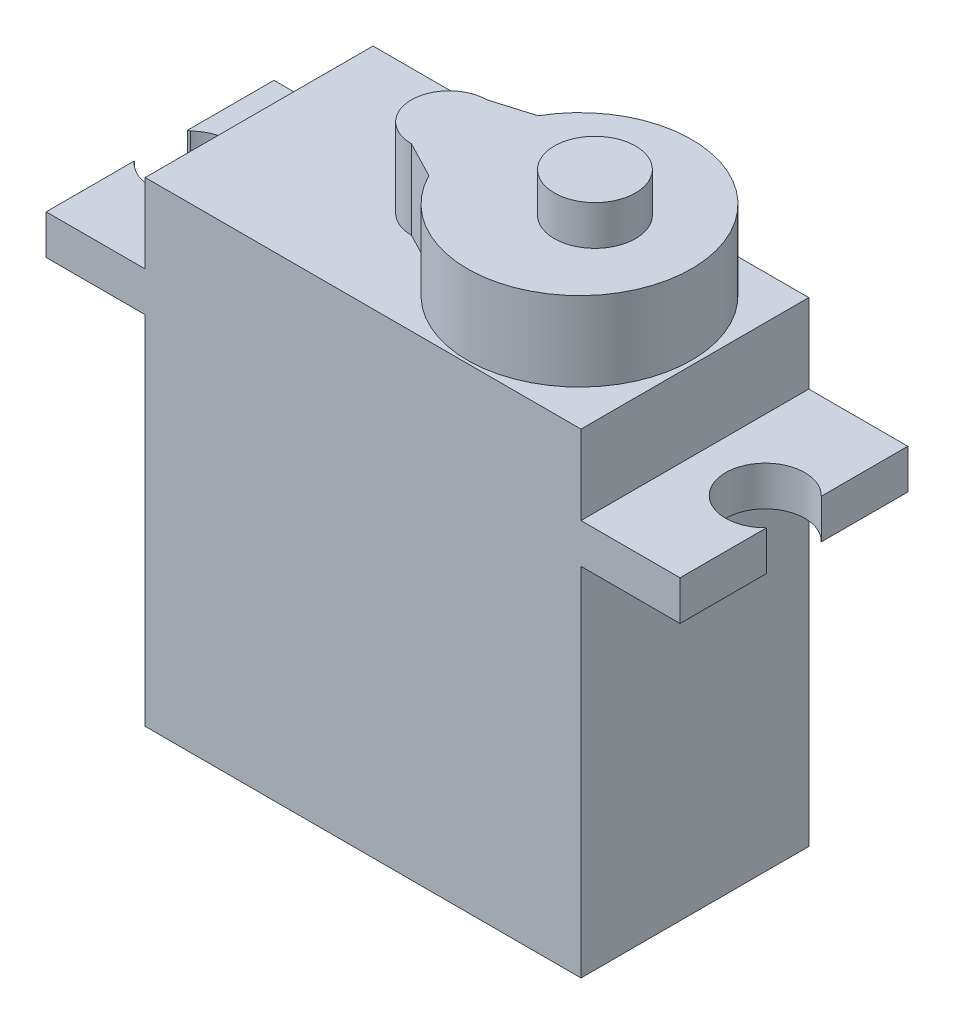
from build123d import *

# Parameters (mm, degrees)
SKETCH1_W                = 22
SKETCH1_H                = 11.5
BOSS_EXTRUDE1_DEPTH      = 24
BOSS_EXTRUDE2_DEPTH      = 5
BOSS_EXTRUDE2_DEPTH_BACK = 27
SKETCH2_W                = 11.5
SKETCH2_H                = 2
CUT_EXTRUDE3_DEPTH       = 7
BOSS_EXTRUDE5_DEPTH      = 4
SKETCH5_R                = 2.051313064
BOSS_EXTRUDE4_DEPTH      = 6


with BuildPart() as part:
    # Sketch1 → Boss-Extrude1 (new body)
    with BuildSketch(Plane(origin=(0, 0, 0), x_dir=(1, 0, 0), z_dir=(0, 1, 0))):
        with Locations((-4.180379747, -2.704113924)):
            Rectangle(SKETCH1_W, SKETCH1_H)
    extrude(amount=BOSS_EXTRUDE1_DEPTH)

    # Sketch2 → Boss-Extrude2 (add, two sides: drawn at the far end of the back side and taken through both)
    with BuildSketch(Plane(origin=(6.819620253, 0, 0), x_dir=(0, 0, -1), z_dir=(1, 0, 0)).offset(-BOSS_EXTRUDE2_DEPTH_BACK)):
        with Locations((-2.704113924, 19)):
            Rectangle(SKETCH2_W, SKETCH2_H)
    extrude(amount=BOSS_EXTRUDE2_DEPTH + BOSS_EXTRUDE2_DEPTH_BACK)

    # Sketch3 → Cut-Extrude3 (cut)
    with BuildSketch(Plane(origin=(0, 20, 0), x_dir=(1, 0, 0), z_dir=(0, 1, 0))):
        with BuildLine():
            Line((13.503056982, -1.626638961), (12.057279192, -1.626638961))
            ThreePointArc((12.057279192, -1.626638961), (8.372331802, -2.704113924), (12.057279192, -3.781588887))
            Line((12.057279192, -3.781588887), (13.503056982, -3.691088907))
            Line((13.503056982, -3.691088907), (13.503056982, -1.626638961))
        make_face()
        with BuildLine():
            Line((-20.064345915, -1.275888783), (-22.31106293, -2.144232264))
            Line((-22.31106293, -2.144232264), (-22.31106293, -3.691088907))
            Line((-22.31106293, -3.691088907), (-20.294992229, -3.862039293))
            ThreePointArc((-20.294992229, -3.862039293), (-16.672191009, -2.881779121), (-20.064345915, -1.275888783))
        make_face()
    extrude(amount=-CUT_EXTRUDE3_DEPTH, mode=Mode.SUBTRACT)

    # Sketch4 → Boss-Extrude5 (add)
    with BuildSketch(Plane(origin=(0, 24, 0), x_dir=(1, 0, 0), z_dir=(0, 1, 0))):
        with BuildLine():
            Line((-5.943202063, -0.428014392), (-3.959842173, 0.166713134))
            ThreePointArc((-3.959842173, 0.166713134), (6.60218912, -2.804775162), (-4.102719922, -5.211260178))
            Line((-4.102719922, -5.211260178), (-5.943202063, -4.256422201))
            ThreePointArc((-5.943202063, -4.256422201), (-7.857405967, -2.342218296), (-5.943202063, -0.428014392))
        make_face()
    extrude(amount=BOSS_EXTRUDE5_DEPTH)

    # Sketch5 → Boss-Extrude4 (add)
    with BuildSketch(Plane(origin=(0, 24, 0), x_dir=(1, 0, 0), z_dir=(0, 1, 0))):
        with Locations(Location((1.819620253, -2.749691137, 0), (0, 0, 270))):
            Circle(SKETCH5_R)
    extrude(amount=BOSS_EXTRUDE4_DEPTH)


solid = part.part
